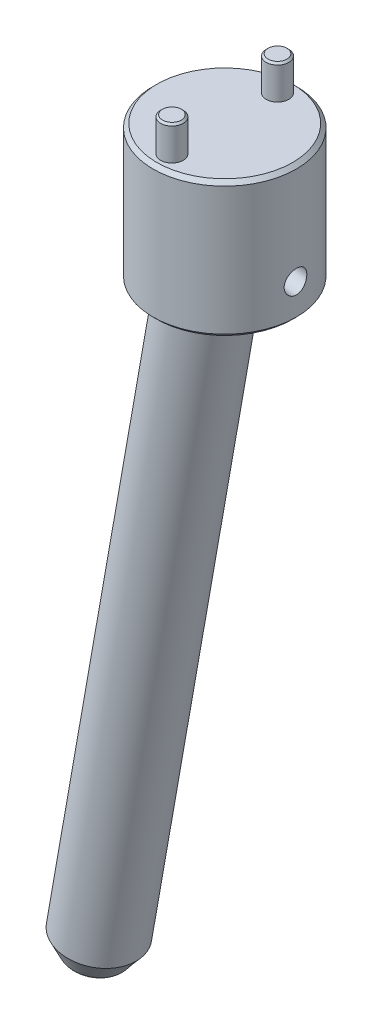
ISO-10303-21;
HEADER;
FILE_DESCRIPTION(('STEP AP214'),'2;1');
FILE_NAME('part.step','',(''),(''),'','','');
FILE_SCHEMA(('AUTOMOTIVE_DESIGN { 1 0 10303 214 1 1 1 1 }'));
ENDSEC;
DATA;
#1=APPLICATION_CONTEXT('core data for automotive mechanical design processes');
#2=APPLICATION_PROTOCOL_DEFINITION('international standard','automotive_design',2000,#1);
#3=PRODUCT_CONTEXT('',#1,'mechanical');
#4=PRODUCT('Part','Part','',(#3));
#5=PRODUCT_RELATED_PRODUCT_CATEGORY('part','',(#4));
#6=PRODUCT_DEFINITION_FORMATION('','',#4);
#7=PRODUCT_DEFINITION_CONTEXT('part definition',#1,'design');
#8=PRODUCT_DEFINITION('design','',#6,#7);
#9=PRODUCT_DEFINITION_SHAPE('','',#8);
#10=(LENGTH_UNIT() NAMED_UNIT(*) SI_UNIT(.MILLI.,.METRE.));
#11=(NAMED_UNIT(*) PLANE_ANGLE_UNIT() SI_UNIT($,.RADIAN.));
#12=(NAMED_UNIT(*) SI_UNIT($,.STERADIAN.) SOLID_ANGLE_UNIT());
#13=UNCERTAINTY_MEASURE_WITH_UNIT(LENGTH_MEASURE(1.E-05),#10,'distance_accuracy_value','');
#14=(GEOMETRIC_REPRESENTATION_CONTEXT(3) GLOBAL_UNCERTAINTY_ASSIGNED_CONTEXT((#13)) GLOBAL_UNIT_ASSIGNED_CONTEXT((#10,
#11,#12)) REPRESENTATION_CONTEXT('',''));
#15=CARTESIAN_POINT('',(0.,0.,0.));
#16=DIRECTION('',(0.,0.,1.));
#17=DIRECTION('',(1.,0.,0.));
#18=AXIS2_PLACEMENT_3D('',#15,#16,#17);
#19=CARTESIAN_POINT('',(-34.388431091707,-208.341356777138,0.));
#20=DIRECTION('',(-0.173648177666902,-0.984807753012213,0.));
#21=DIRECTION('',(0.,0.,-1.));
#22=AXIS2_PLACEMENT_3D('',#19,#20,#21);
#23=PLANE('',#22);
#24=CARTESIAN_POINT('',(-34.388431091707,-208.341356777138,0.));
#25=DIRECTION('',(0.173648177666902,0.984807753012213,0.));
#26=DIRECTION('',(-0.984807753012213,0.173648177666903,0.));
#27=AXIS2_PLACEMENT_3D('',#24,#25,#26);
#28=CIRCLE('',#27,5.38119780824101);
#29=CARTESIAN_POINT('',(-39.6878764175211,-207.406921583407,0.));
#30=VERTEX_POINT('',#29);
#31=CARTESIAN_POINT('',(-29.0889857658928,-209.275791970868,0.));
#32=VERTEX_POINT('',#31);
#33=EDGE_CURVE('P0_E37',#30,#32,#28,.T.);
#34=ORIENTED_EDGE('',*,*,#33,.F.);
#35=CARTESIAN_POINT('',(-34.388431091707,-208.341356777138,0.));
#36=DIRECTION('',(0.173648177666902,0.984807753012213,0.));
#37=DIRECTION('',(0.984807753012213,-0.173648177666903,0.));
#38=AXIS2_PLACEMENT_3D('',#35,#36,#37);
#39=CIRCLE('',#38,5.38119780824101);
#40=EDGE_CURVE('P0_E41',#32,#30,#39,.T.);
#41=ORIENTED_EDGE('',*,*,#40,.F.);
#42=EDGE_LOOP('',(#34,#41));
#43=FACE_BOUND('',#42,.T.);
#44=ADVANCED_FACE('P0_F16',(#43),#23,.T.);
#45=CARTESIAN_POINT('',(-34.0411347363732,-206.371741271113,0.));
#46=DIRECTION('',(-0.173648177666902,-0.984807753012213,0.));
#47=DIRECTION('',(0.984768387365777,-0.173641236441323,0.00894115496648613));
#48=AXIS2_PLACEMENT_3D('',#45,#46,#47);
#49=TOROIDAL_SURFACE('',#48,5.381197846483,2.);
#50=ORIENTED_EDGE('',*,*,#33,.T.);
#51=ORIENTED_EDGE('',*,*,#40,.T.);
#52=EDGE_LOOP('',(#50,#51));
#53=FACE_BOUND('',#52,.T.);
#54=CARTESIAN_POINT('',(-34.2147829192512,-207.356549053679,0.));
#55=DIRECTION('',(0.173648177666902,0.984807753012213,0.));
#56=DIRECTION('',(0.984807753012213,-0.173648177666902,0.));
#57=AXIS2_PLACEMENT_3D('',#54,#55,#56);
#58=CIRCLE('',#57,7.11324863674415);
#59=CARTESIAN_POINT('',(-27.209600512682,-208.591751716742,0.));
#60=VERTEX_POINT('',#59);
#61=EDGE_CURVE('P0_E47',#60,#60,#58,.T.);
#62=ORIENTED_EDGE('',*,*,#61,.F.);
#63=EDGE_LOOP('',(#62));
#64=FACE_BOUND('',#63,.T.);
#65=ADVANCED_FACE('P0_F39',(#53,#64),#49,.T.);
#66=CARTESIAN_POINT('',(1.209445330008,-6.455767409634,0.));
#67=DIRECTION('',(-0.173648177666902,-0.984807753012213,0.));
#68=DIRECTION('',(0.,0.,-1.));
#69=AXIS2_PLACEMENT_3D('',#66,#67,#68);
#70=PLANE('',#69);
#71=CARTESIAN_POINT('',(1.20944536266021,-6.45576722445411,0.));
#72=DIRECTION('',(-0.173648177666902,-0.984807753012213,0.));
#73=DIRECTION('',(0.,0.,-1.));
#74=AXIS2_PLACEMENT_3D('',#71,#72,#73);
#75=CIRCLE('',#74,8.99999984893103);
#76=CARTESIAN_POINT('',(1.20944536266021,-6.45576722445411,-8.99999984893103));
#77=VERTEX_POINT('',#76);
#78=EDGE_CURVE('P0_E84',#77,#77,#75,.T.);
#79=ORIENTED_EDGE('',*,*,#78,.F.);
#80=EDGE_LOOP('',(#79));
#81=FACE_BOUND('',#80,.T.);
#82=ADVANCED_FACE('P0_F75',(#81),#70,.F.);
#83=CARTESIAN_POINT('',(1.93277887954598,-23.8455630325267,0.));
#84=DIRECTION('',(0.984807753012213,-0.173648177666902,0.));
#85=DIRECTION('',(0.,0.,-1.));
#86=AXIS2_PLACEMENT_3D('',#83,#84,#85);
#87=CONICAL_SURFACE('',#86,2.99999999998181,1.04719755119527);
#88=CARTESIAN_POINT('',(0.227041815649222,-23.5447955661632,0.));
#89=VERTEX_POINT('',#88);
#90=VERTEX_LOOP('',#89);
#91=FACE_BOUND('',#90,.T.);
#92=CARTESIAN_POINT('',(1.9327788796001,-23.8455630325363,0.));
#93=DIRECTION('',(0.984807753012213,-0.173648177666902,0.));
#94=DIRECTION('',(0.173648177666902,0.984807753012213,0.));
#95=AXIS2_PLACEMENT_3D('',#92,#93,#94);
#96=CIRCLE('',#95,3.);
#97=CARTESIAN_POINT('',(2.45372341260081,-20.8911397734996,0.));
#98=VERTEX_POINT('',#97);
#99=EDGE_CURVE('P0_E81',#98,#98,#96,.T.);
#100=ORIENTED_EDGE('',*,*,#99,.T.);
#101=EDGE_LOOP('',(#100));
#102=FACE_BOUND('',#101,.T.);
#103=ADVANCED_FACE('P0_F115',(#91,#102),#87,.F.);
#104=CARTESIAN_POINT('',(-33.3465420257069,-202.432510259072,0.));
#105=DIRECTION('',(0.173648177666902,0.984807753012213,0.));
#106=DIRECTION('',(0.,0.,1.));
#107=AXIS2_PLACEMENT_3D('',#104,#105,#106);
#108=CONICAL_SURFACE('',#107,10.0000000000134,0.5235987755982);
#109=CARTESIAN_POINT('',(-33.3465420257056,-202.432510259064,0.));
#110=DIRECTION('',(-0.173648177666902,-0.984807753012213,0.));
#111=DIRECTION('',(0.,0.,-1.));
#112=AXIS2_PLACEMENT_3D('',#109,#110,#111);
#113=CIRCLE('',#112,10.);
#114=CARTESIAN_POINT('',(-33.3465420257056,-202.432510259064,-10.));
#115=VERTEX_POINT('',#114);
#116=EDGE_CURVE('P0_E91',#115,#115,#113,.F.);
#117=ORIENTED_EDGE('',*,*,#116,.F.);
#118=EDGE_LOOP('',(#117));
#119=FACE_BOUND('',#118,.T.);
#120=ORIENTED_EDGE('',*,*,#61,.T.);
#121=EDGE_LOOP('',(#120));
#122=FACE_BOUND('',#121,.T.);
#123=ADVANCED_FACE('P0_F107',(#119,#122),#108,.T.);
#124=CARTESIAN_POINT('',(1.03579712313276,-7.44057532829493,0.));
#125=DIRECTION('',(-0.173648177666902,-0.984807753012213,0.));
#126=DIRECTION('',(0.,0.,-1.));
#127=AXIS2_PLACEMENT_3D('',#124,#125,#126);
#128=CONICAL_SURFACE('',#127,10.0000002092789,0.785398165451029);
#129=CARTESIAN_POINT('',(1.03579708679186,-7.4405755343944,0.));
#130=DIRECTION('',(-0.173648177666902,-0.984807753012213,0.));
#131=DIRECTION('',(0.,0.,-1.));
#132=AXIS2_PLACEMENT_3D('',#129,#130,#131);
#133=CIRCLE('',#132,10.);
#134=CARTESIAN_POINT('',(1.03579708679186,-7.4405755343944,-10.));
#135=VERTEX_POINT('',#134);
#136=EDGE_CURVE('P0_E27',#135,#135,#133,.T.);
#137=ORIENTED_EDGE('',*,*,#136,.F.);
#138=EDGE_LOOP('',(#137));
#139=FACE_BOUND('',#138,.T.);
#140=ORIENTED_EDGE('',*,*,#78,.T.);
#141=EDGE_LOOP('',(#140));
#142=FACE_BOUND('',#141,.T.);
#143=ADVANCED_FACE('P0_F104',(#139,#142),#128,.T.);
#144=CARTESIAN_POINT('',(-0.26536206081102,-23.457971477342,0.));
#145=DIRECTION('',(0.984807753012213,-0.173648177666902,0.));
#146=DIRECTION('',(0.173648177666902,0.984807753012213,0.));
#147=AXIS2_PLACEMENT_3D('',#144,#145,#146);
#148=CYLINDRICAL_SURFACE('',#147,3.);
#149=ORIENTED_EDGE('',*,*,#99,.F.);
#150=EDGE_LOOP('',(#149));
#151=FACE_BOUND('',#150,.T.);
#152=CARTESIAN_POINT('',(8.6264483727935,-21.979557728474,0.));
#153=CARTESIAN_POINT('',(8.62644098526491,-21.9795654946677,-0.164364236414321));
#154=CARTESIAN_POINT('',(8.62005751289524,-21.9922096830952,-0.328908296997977));
#155=CARTESIAN_POINT('',(8.59501270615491,-22.0424361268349,-0.653366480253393));
#156=CARTESIAN_POINT('',(8.57632975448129,-22.0800622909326,-0.813271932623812));
#157=CARTESIAN_POINT('',(8.52822604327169,-22.1790328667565,-1.12348315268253));
#158=CARTESIAN_POINT('',(8.49882733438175,-22.2403285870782,-1.27380789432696));
#159=CARTESIAN_POINT('',(8.43152339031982,-22.3849681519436,-1.56129290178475));
#160=CARTESIAN_POINT('',(8.39361966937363,-22.4683080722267,-1.69845550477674));
#161=CARTESIAN_POINT('',(8.31094433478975,-22.657515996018,-1.95973946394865));
#162=CARTESIAN_POINT('',(8.26601983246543,-22.7639131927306,-2.08342924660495));
#163=CARTESIAN_POINT('',(8.17326349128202,-22.9955088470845,-2.31049290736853));
#164=CARTESIAN_POINT('',(8.12543100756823,-23.1207114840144,-2.41386225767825));
#165=CARTESIAN_POINT('',(8.02909969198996,-23.390202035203,-2.59960101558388));
#166=CARTESIAN_POINT('',(7.98061001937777,-23.5348554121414,-2.68144668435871));
#167=CARTESIAN_POINT('',(7.88747589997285,-23.8374414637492,-2.81842825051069));
#168=CARTESIAN_POINT('',(7.84283050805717,-23.9953708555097,-2.87357072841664));
#169=CARTESIAN_POINT('',(7.76147074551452,-24.3156265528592,-2.95403265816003));
#170=CARTESIAN_POINT('',(7.72456931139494,-24.4777059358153,-2.98014390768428));
#171=CARTESIAN_POINT('',(7.65907486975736,-24.8055748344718,-3.00427461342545));
#172=CARTESIAN_POINT('',(7.63047985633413,-24.9713634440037,-3.00230085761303));
#173=CARTESIAN_POINT('',(7.58327774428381,-25.2955579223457,-2.9709395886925));
#174=CARTESIAN_POINT('',(7.56434735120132,-25.4540142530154,-2.94254427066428));
#175=CARTESIAN_POINT('',(7.53467240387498,-25.7651227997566,-2.86074869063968));
#176=CARTESIAN_POINT('',(7.52392870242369,-25.9177744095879,-2.80734582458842));
#177=CARTESIAN_POINT('',(7.50943193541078,-26.2151430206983,-2.67631861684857));
#178=CARTESIAN_POINT('',(7.50577685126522,-26.3597223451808,-2.59837186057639));
#179=CARTESIAN_POINT('',(7.50403479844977,-26.6348486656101,-2.42069837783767));
#180=CARTESIAN_POINT('',(7.50594885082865,-26.765393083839,-2.32096766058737));
#181=CARTESIAN_POINT('',(7.51351080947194,-27.0141342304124,-2.09764727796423));
#182=CARTESIAN_POINT('',(7.51931073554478,-27.131591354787,-1.97323765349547));
#183=CARTESIAN_POINT('',(7.53250961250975,-27.3441719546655,-1.7065766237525));
#184=CARTESIAN_POINT('',(7.53990924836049,-27.4392858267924,-1.56431758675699));
#185=CARTESIAN_POINT('',(7.55425964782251,-27.6046230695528,-1.26458300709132));
#186=CARTESIAN_POINT('',(7.56120667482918,-27.6746565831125,-1.10700242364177));
#187=CARTESIAN_POINT('',(7.57283983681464,-27.7860885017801,-0.782158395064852));
#188=CARTESIAN_POINT('',(7.57753062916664,-27.8275459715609,-0.61491570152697));
#189=CARTESIAN_POINT('',(7.58187414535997,-27.8653934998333,-0.371824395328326));
#190=CARTESIAN_POINT('',(7.58287592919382,-27.8740121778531,-0.297737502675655));
#191=CARTESIAN_POINT('',(7.58421948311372,-27.8855197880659,-0.14911274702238));
#192=CARTESIAN_POINT('',(7.58456125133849,-27.8884087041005,-0.0745748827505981));
#193=CARTESIAN_POINT('',(7.5845550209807,-27.8883944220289,0.164364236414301));
#194=CARTESIAN_POINT('',(7.5828810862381,-27.8743294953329,0.328908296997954));
#195=CARTESIAN_POINT('',(7.57652512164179,-27.8185662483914,0.653366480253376));
#196=CARTESIAN_POINT('',(7.57183779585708,-27.7768192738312,0.813271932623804));
#197=CARTESIAN_POINT('',(7.5604850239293,-27.6673649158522,1.12348315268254));
#198=CARTESIAN_POINT('',(7.55382364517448,-27.599710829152,1.27380789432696));
#199=CARTESIAN_POINT('',(7.54004827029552,-27.4407747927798,1.56129290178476));
#200=CARTESIAN_POINT('',(7.53293435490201,-27.3494970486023,1.69845550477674));
#201=CARTESIAN_POINT('',(7.51995787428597,-27.1434231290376,1.95973946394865));
#202=CARTESIAN_POINT('',(7.51413263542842,-27.0280773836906,2.08342924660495));
#203=CARTESIAN_POINT('',(7.50618056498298,-26.7787241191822,2.31049290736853));
#204=CARTESIAN_POINT('',(7.50405455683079,-26.6447124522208,2.41386225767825));
#205=CARTESIAN_POINT('',(7.50570392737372,-26.3585269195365,2.59960101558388));
#206=CARTESIAN_POINT('',(7.50961290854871,-26.2060127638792,2.68144668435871));
#207=CARTESIAN_POINT('',(7.52558598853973,-25.8898211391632,2.81842825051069));
#208=CARTESIAN_POINT('',(7.53764807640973,-25.7261464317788,2.87357072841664));
#209=CARTESIAN_POINT('',(7.57072880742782,-25.3973778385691,2.95403265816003));
#210=CARTESIAN_POINT('',(7.59148721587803,-25.2324520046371,2.98014390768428));
#211=CARTESIAN_POINT('',(7.6420803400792,-24.9019556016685,3.00427461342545));
#212=CARTESIAN_POINT('',(7.67191286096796,-24.7363851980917,3.00230085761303));
#213=CARTESIAN_POINT('',(7.73843842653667,-24.4155979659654,2.9709395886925));
#214=CARTESIAN_POINT('',(7.77484493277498,-24.260223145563,2.94254427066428));
#215=CARTESIAN_POINT('',(7.85336499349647,-23.9577273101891,2.86074869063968));
#216=CARTESIAN_POINT('',(7.89547914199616,-23.8106071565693,2.80734582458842));
#217=CARTESIAN_POINT('',(7.98356269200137,-23.526213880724,2.67631861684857));
#218=CARTESIAN_POINT('',(8.02957707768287,-23.3891036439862,2.59837186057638));
#219=CARTESIAN_POINT('',(8.12203882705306,-23.1299736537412,2.42069837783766));
#220=CARTESIAN_POINT('',(8.16848626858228,-23.0079566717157,2.32096766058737));
#221=CARTESIAN_POINT('',(8.26066666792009,-22.7768027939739,2.09764727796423));
#222=CARTESIAN_POINT('',(8.30628951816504,-22.668412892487,1.97323765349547));
#223=CARTESIAN_POINT('',(8.39139925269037,-22.4731667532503,1.7065766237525));
#224=CARTESIAN_POINT('',(8.43088349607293,-22.3863197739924,1.56431758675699));
#225=CARTESIAN_POINT('',(8.5009171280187,-22.2358617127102,1.26458300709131));
#226=CARTESIAN_POINT('',(8.53139807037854,-22.1724277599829,1.10700242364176));
#227=CARTESIAN_POINT('',(8.58044162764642,-22.0716947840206,0.782158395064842));
#228=CARTESIAN_POINT('',(8.59902882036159,-22.0343418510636,0.614915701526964));
#229=CARTESIAN_POINT('',(8.61605500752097,-22.0002623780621,0.371824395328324));
#230=CARTESIAN_POINT('',(8.6199441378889,-21.9925061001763,0.297737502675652));
#231=CARTESIAN_POINT('',(8.62514250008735,-21.9821520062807,0.149112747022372));
#232=CARTESIAN_POINT('',(8.62645172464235,-21.9795542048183,0.0745748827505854));
#233=CARTESIAN_POINT('',(8.6264483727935,-21.979557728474,0.));
#234=B_SPLINE_CURVE_WITH_KNOTS('',3,(#152,#153,#154,#155,#156,#157,#158,#159,#160,#161,#162,
#163,#164,#165,#166,#167,#168,#169,#170,#171,#172,#173,#174,#175,#176,#177,#178,#179,#180,#181,
#182,#183,#184,#185,#186,#187,#188,#189,#190,#191,#192,#193,#194,#195,#196,#197,#198,#199,#200,
#201,#202,#203,#204,#205,#206,#207,#208,#209,#210,#211,#212,#213,#214,#215,#216,#217,#218,#219,
#220,#221,#222,#223,#224,#225,#226,#227,#228,#229,#230,#231,#232,#233),.UNSPECIFIED.,.T.,.F.,(4,
2,2,2,2,2,2,2,2,2,2,2,2,2,2,2,2,2,2,2,2,2,2,2,2,2,2,2,2,2,2,2,2,2,2,2,2,2,2,2,4),(0.,
0.49280574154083,0.986479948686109,1.47914396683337,1.97172034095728,2.47709830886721,
2.98258875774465,3.49943124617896,4.01614630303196,4.51839363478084,5.02051957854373,
5.50451902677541,5.98856888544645,6.47926306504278,6.97004721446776,7.48124851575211,
7.99266913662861,8.507883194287,9.02202912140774,9.24562293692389,9.4692173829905,
9.96202312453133,10.4556973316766,10.9483613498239,11.4409377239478,11.9463156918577,
12.4518061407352,12.9686486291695,13.4853636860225,13.9876110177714,14.4897369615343,
14.9737364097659,15.457786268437,15.9484804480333,16.4392645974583,16.9504658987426,
17.4618865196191,17.9771005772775,18.4912465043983,18.7148403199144,18.938434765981),.UNSPECIFIED.);
#235=CARTESIAN_POINT('',(8.6264483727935,-21.979557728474,0.));
#236=VERTEX_POINT('',#235);
#237=EDGE_CURVE('P0_E10',#236,#236,#234,.T.);
#238=ORIENTED_EDGE('',*,*,#237,.F.);
#239=EDGE_LOOP('',(#238));
#240=FACE_BOUND('',#239,.T.);
#241=ADVANCED_FACE('P0_F106',(#151,#240),#148,.F.);
#242=CARTESIAN_POINT('',(2.98933915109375,3.63851205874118,0.));
#243=DIRECTION('',(-0.173648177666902,-0.984807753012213,0.));
#244=DIRECTION('',(0.,0.,-1.));
#245=AXIS2_PLACEMENT_3D('',#242,#243,#244);
#246=CYLINDRICAL_SURFACE('',#245,10.);
#247=ORIENTED_EDGE('',*,*,#116,.T.);
#248=EDGE_LOOP('',(#247));
#249=FACE_BOUND('',#248,.T.);
#250=ORIENTED_EDGE('',*,*,#136,.T.);
#251=EDGE_LOOP('',(#250));
#252=FACE_BOUND('',#251,.T.);
#253=ORIENTED_EDGE('',*,*,#237,.T.);
#254=EDGE_LOOP('',(#253));
#255=FACE_BOUND('',#254,.T.);
#256=ADVANCED_FACE('P0_F101',(#249,#252,#255),#246,.T.);
#257=CLOSED_SHELL('',(#44,#65,#82,#103,#123,#143,#241,#256));
#258=MANIFOLD_SOLID_BREP('P0_B1',#257);
#259=CARTESIAN_POINT('',(0.,9.,0.));
#260=DIRECTION('',(0.,1.,0.));
#261=DIRECTION('',(-1.,0.,0.));
#262=AXIS2_PLACEMENT_3D('',#259,#260,#261);
#263=PLANE('',#262);
#264=CARTESIAN_POINT('',(0.,9.,-14.));
#265=DIRECTION('',(0.,1.,0.));
#266=DIRECTION('',(-1.,0.,0.));
#267=AXIS2_PLACEMENT_3D('',#264,#265,#266);
#268=CIRCLE('',#267,2.49998893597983);
#269=CARTESIAN_POINT('',(-2.49998893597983,9.,-14.));
#270=VERTEX_POINT('',#269);
#271=EDGE_CURVE('P1_E18',#270,#270,#268,.F.);
#272=ORIENTED_EDGE('',*,*,#271,.F.);
#273=EDGE_LOOP('',(#272));
#274=FACE_BOUND('',#273,.T.);
#275=ADVANCED_FACE('P1_F15',(#274),#263,.T.);
#276=CARTESIAN_POINT('',(0.,9.,0.));
#277=DIRECTION('',(0.,1.,0.));
#278=DIRECTION('',(-1.,0.,0.));
#279=AXIS2_PLACEMENT_3D('',#276,#277,#278);
#280=PLANE('',#279);
#281=CARTESIAN_POINT('',(0.,9.,14.));
#282=DIRECTION('',(0.,1.,0.));
#283=DIRECTION('',(-1.,0.,0.));
#284=AXIS2_PLACEMENT_3D('',#281,#282,#283);
#285=CIRCLE('',#284,2.49998893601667);
#286=CARTESIAN_POINT('',(-2.49998893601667,9.,14.));
#287=VERTEX_POINT('',#286);
#288=EDGE_CURVE('P1_E115',#287,#287,#285,.F.);
#289=ORIENTED_EDGE('',*,*,#288,.F.);
#290=EDGE_LOOP('',(#289));
#291=FACE_BOUND('',#290,.T.);
#292=ADVANCED_FACE('P1_F105',(#291),#280,.T.);
#293=CARTESIAN_POINT('',(1.209445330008,-6.455767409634,0.));
#294=DIRECTION('',(0.173648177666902,0.984807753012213,0.));
#295=DIRECTION('',(-0.984807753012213,0.173648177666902,0.));
#296=AXIS2_PLACEMENT_3D('',#293,#294,#295);
#297=PLANE('',#296);
#298=CARTESIAN_POINT('',(1.20944533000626,-6.4557674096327,0.));
#299=DIRECTION('',(0.173648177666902,0.984807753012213,0.));
#300=DIRECTION('',(-0.984807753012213,0.173648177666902,0.));
#301=AXIS2_PLACEMENT_3D('',#298,#299,#300);
#302=CIRCLE('',#301,10.);
#303=CARTESIAN_POINT('',(-8.63863220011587,-4.71928563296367,0.));
#304=VERTEX_POINT('',#303);
#305=EDGE_CURVE('P1_E117',#304,#304,#302,.F.);
#306=ORIENTED_EDGE('',*,*,#305,.T.);
#307=EDGE_LOOP('',(#306));
#308=FACE_BOUND('',#307,.T.);
#309=ADVANCED_FACE('P1_F102',(#308),#297,.F.);
#310=CARTESIAN_POINT('',(0.,8.49999144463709,-14.));
#311=DIRECTION('',(0.,-1.,0.));
#312=DIRECTION('',(1.,0.,0.));
#313=AXIS2_PLACEMENT_3D('',#310,#311,#312);
#314=CONICAL_SURFACE('',#313,2.99999527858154,0.785395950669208);
#315=CARTESIAN_POINT('',(0.,8.49998672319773,-14.));
#316=DIRECTION('',(0.,-1.,0.));
#317=DIRECTION('',(1.,0.,0.));
#318=AXIS2_PLACEMENT_3D('',#315,#316,#317);
#319=CIRCLE('',#318,3.);
#320=CARTESIAN_POINT('',(3.,8.49998672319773,-14.));
#321=VERTEX_POINT('',#320);
#322=EDGE_CURVE('P1_E119',#321,#321,#319,.T.);
#323=ORIENTED_EDGE('',*,*,#322,.F.);
#324=EDGE_LOOP('',(#323));
#325=FACE_BOUND('',#324,.T.);
#326=ORIENTED_EDGE('',*,*,#271,.T.);
#327=EDGE_LOOP('',(#326));
#328=FACE_BOUND('',#327,.T.);
#329=ADVANCED_FACE('P1_F98',(#325,#328),#314,.T.);
#330=CARTESIAN_POINT('',(0.,8.49999144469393,14.));
#331=DIRECTION('',(0.,-1.,0.));
#332=DIRECTION('',(1.,0.,0.));
#333=AXIS2_PLACEMENT_3D('',#330,#331,#332);
#334=CONICAL_SURFACE('',#333,2.99999527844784,0.785395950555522);
#335=CARTESIAN_POINT('',(0.,8.49998672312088,14.));
#336=DIRECTION('',(0.,-1.,0.));
#337=DIRECTION('',(1.,0.,0.));
#338=AXIS2_PLACEMENT_3D('',#335,#336,#337);
#339=CIRCLE('',#338,3.);
#340=CARTESIAN_POINT('',(3.,8.49998672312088,14.));
#341=VERTEX_POINT('',#340);
#342=EDGE_CURVE('P1_E124',#341,#341,#339,.T.);
#343=ORIENTED_EDGE('',*,*,#342,.F.);
#344=EDGE_LOOP('',(#343));
#345=FACE_BOUND('',#344,.T.);
#346=ORIENTED_EDGE('',*,*,#288,.T.);
#347=EDGE_LOOP('',(#346));
#348=FACE_BOUND('',#347,.T.);
#349=ADVANCED_FACE('P1_F93',(#345,#348),#334,.T.);
#350=CARTESIAN_POINT('',(-6.41042959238,-49.67022552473,0.));
#351=DIRECTION('',(0.173648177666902,0.984807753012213,0.));
#352=DIRECTION('',(-0.984807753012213,0.173648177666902,0.));
#353=AXIS2_PLACEMENT_3D('',#350,#351,#352);
#354=CYLINDRICAL_SURFACE('',#353,10.);
#355=CARTESIAN_POINT('',(-4.00000000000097,-36.,0.));
#356=DIRECTION('',(0.,-1.,0.));
#357=DIRECTION('',(1.,0.,0.));
#358=AXIS2_PLACEMENT_3D('',#355,#356,#357);
#359=ELLIPSE('',#358,10.1542661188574,10.);
#360=CARTESIAN_POINT('',(6.15426611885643,-36.,0.));
#361=VERTEX_POINT('',#360);
#362=EDGE_CURVE('P1_E80',#361,#361,#359,.F.);
#363=ORIENTED_EDGE('',*,*,#362,.F.);
#364=EDGE_LOOP('',(#363));
#365=FACE_BOUND('',#364,.T.);
#366=ORIENTED_EDGE('',*,*,#305,.F.);
#367=EDGE_LOOP('',(#366));
#368=FACE_BOUND('',#367,.T.);
#369=CARTESIAN_POINT('',(7.58455930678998,-27.8884042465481,0.));
#370=CARTESIAN_POINT('',(7.58455502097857,-27.8883944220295,-0.16436423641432));
#371=CARTESIAN_POINT('',(7.58288108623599,-27.8743294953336,-0.328908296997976));
#372=CARTESIAN_POINT('',(7.57652512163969,-27.8185662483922,-0.653366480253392));
#373=CARTESIAN_POINT('',(7.57183779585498,-27.776819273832,-0.813271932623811));
#374=CARTESIAN_POINT('',(7.5604850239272,-27.667364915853,-1.12348315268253));
#375=CARTESIAN_POINT('',(7.55382364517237,-27.5997108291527,-1.27380789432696));
#376=CARTESIAN_POINT('',(7.54004827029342,-27.4407747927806,-1.56129290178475));
#377=CARTESIAN_POINT('',(7.53293435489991,-27.3494970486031,-1.69845550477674));
#378=CARTESIAN_POINT('',(7.51995787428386,-27.1434231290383,-1.95973946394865));
#379=CARTESIAN_POINT('',(7.51413263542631,-27.0280773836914,-2.08342924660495));
#380=CARTESIAN_POINT('',(7.50618056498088,-26.778724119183,-2.31049290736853));
#381=CARTESIAN_POINT('',(7.50405455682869,-26.6447124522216,-2.41386225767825));
#382=CARTESIAN_POINT('',(7.50570392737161,-26.3585269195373,-2.59960101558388));
#383=CARTESIAN_POINT('',(7.5096129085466,-26.2060127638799,-2.68144668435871));
#384=CARTESIAN_POINT('',(7.52558598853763,-25.889821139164,-2.81842825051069));
#385=CARTESIAN_POINT('',(7.53764807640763,-25.7261464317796,-2.87357072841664));
#386=CARTESIAN_POINT('',(7.57072880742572,-25.3973778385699,-2.95403265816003));
#387=CARTESIAN_POINT('',(7.59148721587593,-25.2324520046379,-2.98014390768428));
#388=CARTESIAN_POINT('',(7.64208034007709,-24.9019556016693,-3.00427461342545));
#389=CARTESIAN_POINT('',(7.67191286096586,-24.7363851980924,-3.00230085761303));
#390=CARTESIAN_POINT('',(7.73843842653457,-24.4155979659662,-2.9709395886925));
#391=CARTESIAN_POINT('',(7.77484493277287,-24.2602231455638,-2.94254427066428));
#392=CARTESIAN_POINT('',(7.85336499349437,-23.9577273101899,-2.86074869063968));
#393=CARTESIAN_POINT('',(7.89547914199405,-23.8106071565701,-2.80734582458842));
#394=CARTESIAN_POINT('',(7.98356269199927,-23.5262138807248,-2.67631861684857));
#395=CARTESIAN_POINT('',(8.02957707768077,-23.389103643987,-2.59837186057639));
#396=CARTESIAN_POINT('',(8.12203882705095,-23.129973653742,-2.42069837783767));
#397=CARTESIAN_POINT('',(8.16848626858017,-23.0079566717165,-2.32096766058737));
#398=CARTESIAN_POINT('',(8.26066666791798,-22.7768027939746,-2.09764727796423));
#399=CARTESIAN_POINT('',(8.30628951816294,-22.6684128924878,-1.97323765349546));
#400=CARTESIAN_POINT('',(8.39139925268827,-22.473166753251,-1.70657662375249));
#401=CARTESIAN_POINT('',(8.43088349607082,-22.3863197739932,-1.56431758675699));
#402=CARTESIAN_POINT('',(8.50091712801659,-22.235861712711,-1.26458300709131));
#403=CARTESIAN_POINT('',(8.53139807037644,-22.1724277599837,-1.10700242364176));
#404=CARTESIAN_POINT('',(8.58044162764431,-22.0716947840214,-0.782158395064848));
#405=CARTESIAN_POINT('',(8.59902882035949,-22.0343418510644,-0.614915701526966));
#406=CARTESIAN_POINT('',(8.61605500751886,-22.0002623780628,-0.371824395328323));
#407=CARTESIAN_POINT('',(8.61994413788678,-21.9925061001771,-0.297737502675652));
#408=CARTESIAN_POINT('',(8.62514250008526,-21.9821520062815,-0.149112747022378));
#409=CARTESIAN_POINT('',(8.62645172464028,-21.979554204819,-0.0745748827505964));
#410=CARTESIAN_POINT('',(8.62644098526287,-21.9795654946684,0.164364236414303));
#411=CARTESIAN_POINT('',(8.62005751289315,-21.9922096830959,0.328908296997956));
#412=CARTESIAN_POINT('',(8.5950127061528,-22.0424361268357,0.653366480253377));
#413=CARTESIAN_POINT('',(8.57632975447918,-22.0800622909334,0.813271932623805));
#414=CARTESIAN_POINT('',(8.52822604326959,-22.1790328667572,1.12348315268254));
#415=CARTESIAN_POINT('',(8.49882733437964,-22.240328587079,1.27380789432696));
#416=CARTESIAN_POINT('',(8.43152339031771,-22.3849681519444,1.56129290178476));
#417=CARTESIAN_POINT('',(8.39361966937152,-22.4683080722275,1.69845550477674));
#418=CARTESIAN_POINT('',(8.31094433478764,-22.6575159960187,1.95973946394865));
#419=CARTESIAN_POINT('',(8.26601983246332,-22.7639131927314,2.08342924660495));
#420=CARTESIAN_POINT('',(8.17326349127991,-22.9955088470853,2.31049290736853));
#421=CARTESIAN_POINT('',(8.12543100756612,-23.1207114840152,2.41386225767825));
#422=CARTESIAN_POINT('',(8.02909969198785,-23.3902020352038,2.59960101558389));
#423=CARTESIAN_POINT('',(7.98061001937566,-23.5348554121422,2.68144668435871));
#424=CARTESIAN_POINT('',(7.88747589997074,-23.83744146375,2.81842825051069));
#425=CARTESIAN_POINT('',(7.84283050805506,-23.9953708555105,2.87357072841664));
#426=CARTESIAN_POINT('',(7.76147074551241,-24.3156265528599,2.95403265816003));
#427=CARTESIAN_POINT('',(7.72456931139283,-24.4777059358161,2.98014390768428));
#428=CARTESIAN_POINT('',(7.65907486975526,-24.8055748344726,3.00427461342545));
#429=CARTESIAN_POINT('',(7.63047985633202,-24.9713634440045,3.00230085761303));
#430=CARTESIAN_POINT('',(7.5832777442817,-25.2955579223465,2.9709395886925));
#431=CARTESIAN_POINT('',(7.56434735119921,-25.4540142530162,2.94254427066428));
#432=CARTESIAN_POINT('',(7.53467240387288,-25.7651227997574,2.86074869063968));
#433=CARTESIAN_POINT('',(7.52392870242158,-25.9177744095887,2.80734582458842));
#434=CARTESIAN_POINT('',(7.50943193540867,-26.2151430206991,2.67631861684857));
#435=CARTESIAN_POINT('',(7.50577685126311,-26.3597223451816,2.59837186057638));
#436=CARTESIAN_POINT('',(7.50403479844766,-26.6348486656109,2.42069837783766));
#437=CARTESIAN_POINT('',(7.50594885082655,-26.7653930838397,2.32096766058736));
#438=CARTESIAN_POINT('',(7.51351080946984,-27.0141342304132,2.09764727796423));
#439=CARTESIAN_POINT('',(7.51931073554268,-27.1315913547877,1.97323765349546));
#440=CARTESIAN_POINT('',(7.53250961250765,-27.3441719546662,1.70657662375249));
#441=CARTESIAN_POINT('',(7.53990924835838,-27.4392858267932,1.56431758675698));
#442=CARTESIAN_POINT('',(7.55425964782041,-27.6046230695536,1.26458300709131));
#443=CARTESIAN_POINT('',(7.56120667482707,-27.6746565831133,1.10700242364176));
#444=CARTESIAN_POINT('',(7.57283983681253,-27.7860885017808,0.782158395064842));
#445=CARTESIAN_POINT('',(7.57753062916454,-27.8275459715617,0.614915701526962));
#446=CARTESIAN_POINT('',(7.58187414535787,-27.8653934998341,0.371824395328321));
#447=CARTESIAN_POINT('',(7.58287592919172,-27.8740121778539,0.297737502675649));
#448=CARTESIAN_POINT('',(7.58421948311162,-27.8855197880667,0.149112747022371));
#449=CARTESIAN_POINT('',(7.58456125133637,-27.8884087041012,0.0745748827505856));
#450=CARTESIAN_POINT('',(7.58455930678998,-27.8884042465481,0.));
#451=B_SPLINE_CURVE_WITH_KNOTS('',3,(#369,#370,#371,#372,#373,#374,#375,#376,#377,#378,#379,
#380,#381,#382,#383,#384,#385,#386,#387,#388,#389,#390,#391,#392,#393,#394,#395,#396,#397,#398,
#399,#400,#401,#402,#403,#404,#405,#406,#407,#408,#409,#410,#411,#412,#413,#414,#415,#416,#417,
#418,#419,#420,#421,#422,#423,#424,#425,#426,#427,#428,#429,#430,#431,#432,#433,#434,#435,#436,
#437,#438,#439,#440,#441,#442,#443,#444,#445,#446,#447,#448,#449,#450),.UNSPECIFIED.,.T.,.F.,(4,
2,2,2,2,2,2,2,2,2,2,2,2,2,2,2,2,2,2,2,2,2,2,2,2,2,2,2,2,2,2,2,2,2,2,2,2,2,2,2,4),(0.,
0.49280574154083,0.98647994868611,1.47914396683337,1.97172034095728,2.47709830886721,
2.98258875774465,3.49943124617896,4.01614630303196,4.51839363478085,5.02051957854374,
5.50451902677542,5.98856888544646,6.47926306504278,6.97004721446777,7.48124851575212,
7.99266913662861,8.507883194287,9.02202912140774,9.24562293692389,9.4692173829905,
9.96202312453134,10.4556973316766,10.9483613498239,11.4409377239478,11.9463156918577,
12.4518061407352,12.9686486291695,13.4853636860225,13.9876110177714,14.4897369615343,
14.9737364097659,15.457786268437,15.9484804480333,16.4392645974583,16.9504658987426,
17.4618865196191,17.9771005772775,18.4912465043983,18.7148403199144,18.938434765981),.UNSPECIFIED.);
#452=CARTESIAN_POINT('',(7.58455930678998,-27.8884042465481,0.));
#453=VERTEX_POINT('',#452);
#454=EDGE_CURVE('P1_E77',#453,#453,#451,.T.);
#455=ORIENTED_EDGE('',*,*,#454,.T.);
#456=EDGE_LOOP('',(#455));
#457=FACE_BOUND('',#456,.T.);
#458=ADVANCED_FACE('P1_F87',(#365,#368,#457),#354,.F.);
#459=CARTESIAN_POINT('',(0.,0.,-14.));
#460=DIRECTION('',(0.,1.,0.));
#461=DIRECTION('',(-1.,0.,0.));
#462=AXIS2_PLACEMENT_3D('',#459,#460,#461);
#463=CYLINDRICAL_SURFACE('',#462,3.);
#464=CARTESIAN_POINT('',(0.,0.,-14.));
#465=DIRECTION('',(0.,1.,0.));
#466=DIRECTION('',(-1.,0.,0.));
#467=AXIS2_PLACEMENT_3D('',#464,#465,#466);
#468=CIRCLE('',#467,3.);
#469=CARTESIAN_POINT('',(-3.,0.,-14.));
#470=VERTEX_POINT('',#469);
#471=EDGE_CURVE('P1_E73',#470,#470,#468,.T.);
#472=ORIENTED_EDGE('',*,*,#471,.T.);
#473=EDGE_LOOP('',(#472));
#474=FACE_BOUND('',#473,.T.);
#475=ORIENTED_EDGE('',*,*,#322,.T.);
#476=EDGE_LOOP('',(#475));
#477=FACE_BOUND('',#476,.T.);
#478=ADVANCED_FACE('P1_F92',(#474,#477),#463,.T.);
#479=CARTESIAN_POINT('',(0.,0.,14.));
#480=DIRECTION('',(0.,1.,0.));
#481=DIRECTION('',(-1.,0.,0.));
#482=AXIS2_PLACEMENT_3D('',#479,#480,#481);
#483=CYLINDRICAL_SURFACE('',#482,3.);
#484=CARTESIAN_POINT('',(0.,0.,14.));
#485=DIRECTION('',(0.,1.,0.));
#486=DIRECTION('',(-1.,0.,0.));
#487=AXIS2_PLACEMENT_3D('',#484,#485,#486);
#488=CIRCLE('',#487,3.);
#489=CARTESIAN_POINT('',(-3.,0.,14.));
#490=VERTEX_POINT('',#489);
#491=EDGE_CURVE('P1_E69',#490,#490,#488,.T.);
#492=ORIENTED_EDGE('',*,*,#491,.T.);
#493=EDGE_LOOP('',(#492));
#494=FACE_BOUND('',#493,.T.);
#495=ORIENTED_EDGE('',*,*,#342,.T.);
#496=EDGE_LOOP('',(#495));
#497=FACE_BOUND('',#496,.T.);
#498=ADVANCED_FACE('P1_F140',(#494,#497),#483,.T.);
#499=CARTESIAN_POINT('',(0.,-36.,0.));
#500=DIRECTION('',(0.,-1.,0.));
#501=DIRECTION('',(1.,0.,0.));
#502=AXIS2_PLACEMENT_3D('',#499,#500,#501);
#503=PLANE('',#502);
#504=ORIENTED_EDGE('',*,*,#362,.T.);
#505=EDGE_LOOP('',(#504));
#506=FACE_BOUND('',#505,.T.);
#507=CARTESIAN_POINT('',(0.,-36.,0.));
#508=DIRECTION('',(0.,-1.,0.));
#509=DIRECTION('',(1.,0.,0.));
#510=AXIS2_PLACEMENT_3D('',#507,#508,#509);
#511=CIRCLE('',#510,17.9999935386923);
#512=CARTESIAN_POINT('',(17.9999935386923,-36.,0.));
#513=VERTEX_POINT('',#512);
#514=EDGE_CURVE('P1_E39',#513,#513,#511,.F.);
#515=ORIENTED_EDGE('',*,*,#514,.F.);
#516=EDGE_LOOP('',(#515));
#517=FACE_BOUND('',#516,.T.);
#518=ADVANCED_FACE('P1_F64',(#506,#517),#503,.T.);
#519=CARTESIAN_POINT('',(-6.0610902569,-22.43602822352,0.));
#520=DIRECTION('',(0.984807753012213,-0.173648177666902,0.));
#521=DIRECTION('',(0.173648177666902,0.984807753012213,0.));
#522=AXIS2_PLACEMENT_3D('',#519,#520,#521);
#523=CYLINDRICAL_SURFACE('',#522,3.);
#524=ORIENTED_EDGE('',*,*,#454,.F.);
#525=EDGE_LOOP('',(#524));
#526=FACE_BOUND('',#525,.T.);
#527=CARTESIAN_POINT('',(19.,-23.8086947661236,0.));
#528=CARTESIAN_POINT('',(18.9999968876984,-23.8087019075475,-0.168302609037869));
#529=CARTESIAN_POINT('',(18.9977389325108,-23.822733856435,-0.336810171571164));
#530=CARTESIAN_POINT('',(18.9889402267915,-23.8785693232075,-0.669274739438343));
#531=CARTESIAN_POINT('',(18.9823910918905,-23.9204272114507,-0.833222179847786));
#532=CARTESIAN_POINT('',(18.965738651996,-24.0308235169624,-1.15158233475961));
#533=CARTESIAN_POINT('',(18.9556378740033,-24.0993429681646,-1.30600173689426));
#534=CARTESIAN_POINT('',(18.9330110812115,-24.2612184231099,-1.60093485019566));
#535=CARTESIAN_POINT('',(18.9204861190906,-24.3545636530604,-1.74145455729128));
#536=CARTESIAN_POINT('',(18.8944284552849,-24.5634676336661,-2.00450802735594));
#537=CARTESIAN_POINT('',(18.8808969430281,-24.6790004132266,-2.12706252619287));
#538=CARTESIAN_POINT('',(18.8543376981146,-24.9291711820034,-2.35089087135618));
#539=CARTESIAN_POINT('',(18.8413099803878,-25.0638097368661,-2.45216408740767));
#540=CARTESIAN_POINT('',(18.8172794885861,-25.3478013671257,-2.63022108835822));
#541=CARTESIAN_POINT('',(18.8062687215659,-25.4970925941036,-2.70710246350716));
#542=CARTESIAN_POINT('',(18.7874299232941,-25.8065774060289,-2.83490279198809));
#543=CARTESIAN_POINT('',(18.7796018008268,-25.9667706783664,-2.88582248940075));
#544=CARTESIAN_POINT('',(18.7679618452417,-26.2936911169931,-2.96058361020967));
#545=CARTESIAN_POINT('',(18.7641549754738,-26.4604260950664,-2.98439157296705));
#546=CARTESIAN_POINT('',(18.7609422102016,-26.7955804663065,-3.00452162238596));
#547=CARTESIAN_POINT('',(18.7615367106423,-26.9640000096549,-3.00084123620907));
#548=CARTESIAN_POINT('',(18.7670496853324,-27.3008544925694,-2.96616831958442));
#549=CARTESIAN_POINT('',(18.772042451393,-27.4692397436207,-2.93470650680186));
#550=CARTESIAN_POINT('',(18.7858483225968,-27.7985550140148,-2.8449855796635));
#551=CARTESIAN_POINT('',(18.7946621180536,-27.9594836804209,-2.78672162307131));
#552=CARTESIAN_POINT('',(18.8153925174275,-28.2737770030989,-2.64317643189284));
#553=CARTESIAN_POINT('',(18.8273848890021,-28.4268298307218,-2.55722258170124));
#554=CARTESIAN_POINT('',(18.8529853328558,-28.7163870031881,-2.36107996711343));
#555=CARTESIAN_POINT('',(18.8665934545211,-28.8528908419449,-2.25089046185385));
#556=CARTESIAN_POINT('',(18.8939758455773,-29.1062156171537,-2.00814772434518));
#557=CARTESIAN_POINT('',(18.9077506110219,-29.2228919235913,-1.87544319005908));
#558=CARTESIAN_POINT('',(18.9337530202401,-29.431528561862,-1.59163092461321));
#559=CARTESIAN_POINT('',(18.9459802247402,-29.5234818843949,-1.44051799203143));
#560=CARTESIAN_POINT('',(18.9670541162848,-29.6767845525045,-1.12888993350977));
#561=CARTESIAN_POINT('',(18.9759927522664,-29.7389838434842,-0.968803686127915));
#562=CARTESIAN_POINT('',(18.9864330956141,-29.8104420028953,-0.722605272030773));
#563=CARTESIAN_POINT('',(18.9894176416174,-29.8306152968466,-0.63958291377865));
#564=CARTESIAN_POINT('',(18.9943189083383,-29.863544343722,-0.472063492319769));
#565=CARTESIAN_POINT('',(18.996236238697,-29.876304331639,-0.387567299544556));
#566=CARTESIAN_POINT('',(18.9983898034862,-29.8906020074,-0.252420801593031));
#567=CARTESIAN_POINT('',(18.9989927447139,-29.8945942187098,-0.202022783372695));
#568=CARTESIAN_POINT('',(18.9997983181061,-29.8999219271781,-0.101090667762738));
#569=CARTESIAN_POINT('',(19.0000009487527,-29.9012574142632,-0.0505565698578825));
#570=CARTESIAN_POINT('',(18.9999969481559,-29.901244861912,0.16262485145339));
#571=CARTESIAN_POINT('',(18.9978874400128,-29.8873860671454,0.325482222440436));
#572=CARTESIAN_POINT('',(18.9896757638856,-29.8324296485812,0.646650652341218));
#573=CARTESIAN_POINT('',(18.9835649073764,-29.7912727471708,0.804951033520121));
#574=CARTESIAN_POINT('',(18.9680525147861,-29.6833849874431,1.11200883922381));
#575=CARTESIAN_POINT('',(18.9586583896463,-29.6167116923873,1.26078687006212));
#576=CARTESIAN_POINT('',(18.9375942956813,-29.460149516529,1.54528376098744));
#577=CARTESIAN_POINT('',(18.9259250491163,-29.3702680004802,1.6810067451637));
#578=CARTESIAN_POINT('',(18.9011726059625,-29.1672777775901,1.93986289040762));
#579=CARTESIAN_POINT('',(18.888059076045,-29.053591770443,2.06254000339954));
#580=CARTESIAN_POINT('',(18.862074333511,-28.8079373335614,2.28802634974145));
#581=CARTESIAN_POINT('',(18.8492031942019,-28.6759634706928,2.39082965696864));
#582=CARTESIAN_POINT('',(18.8245085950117,-28.3911542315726,2.57822041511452));
#583=CARTESIAN_POINT('',(18.812755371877,-28.2376597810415,2.66181709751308));
#584=CARTESIAN_POINT('',(18.7922989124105,-27.9187998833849,2.80260348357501));
#585=CARTESIAN_POINT('',(18.7835959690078,-27.7534332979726,2.85979065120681));
#586=CARTESIAN_POINT('',(18.7701836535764,-27.413235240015,2.94655388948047));
#587=CARTESIAN_POINT('',(18.7655251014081,-27.2383118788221,2.9757790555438));
#588=CARTESIAN_POINT('',(18.7610035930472,-26.8859755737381,3.00415775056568));
#589=CARTESIAN_POINT('',(18.7611400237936,-26.70856295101,3.00331512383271));
#590=CARTESIAN_POINT('',(18.7662073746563,-26.3601929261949,2.97148176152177));
#591=CARTESIAN_POINT('',(18.7710399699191,-26.1891777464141,2.94110929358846));
#592=CARTESIAN_POINT('',(18.7848386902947,-25.8550071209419,2.85164291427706));
#593=CARTESIAN_POINT('',(18.7938042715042,-25.6918506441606,2.79255278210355));
#594=CARTESIAN_POINT('',(18.8145742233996,-25.3821749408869,2.64894259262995));
#595=CARTESIAN_POINT('',(18.8263044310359,-25.2353480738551,2.56507439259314));
#596=CARTESIAN_POINT('',(18.8513824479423,-24.9581446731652,2.37374242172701));
#597=CARTESIAN_POINT('',(18.8647300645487,-24.8277661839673,2.26628146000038));
#598=CARTESIAN_POINT('',(18.8914194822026,-24.5880964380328,2.03176144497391));
#599=CARTESIAN_POINT('',(18.9047604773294,-24.4786449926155,1.90486586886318));
#600=CARTESIAN_POINT('',(18.9300620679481,-24.2824609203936,1.63437175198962));
#601=CARTESIAN_POINT('',(18.9420220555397,-24.1957382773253,1.49076591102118));
#602=CARTESIAN_POINT('',(18.9632731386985,-24.0470820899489,1.19038991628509));
#603=CARTESIAN_POINT('',(18.9725535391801,-23.9852475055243,1.03357015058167));
#604=CARTESIAN_POINT('',(18.9873386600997,-23.8885664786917,0.711876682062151));
#605=CARTESIAN_POINT('',(18.9928506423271,-23.8536681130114,0.547019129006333));
#606=CARTESIAN_POINT('',(18.9974535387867,-23.8246587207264,0.317466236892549));
#607=CARTESIAN_POINT('',(18.998406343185,-23.8186766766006,0.254132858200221));
#608=CARTESIAN_POINT('',(18.999680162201,-23.810693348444,0.12720941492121));
#609=CARTESIAN_POINT('',(19.0000011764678,-23.8086920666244,0.0636193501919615));
#610=CARTESIAN_POINT('',(19.,-23.8086947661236,0.));
#611=B_SPLINE_CURVE_WITH_KNOTS('',3,(#527,#528,#529,#530,#531,#532,#533,#534,#535,#536,#537,
#538,#539,#540,#541,#542,#543,#544,#545,#546,#547,#548,#549,#550,#551,#552,#553,#554,#555,#556,
#557,#558,#559,#560,#561,#562,#563,#564,#565,#566,#567,#568,#569,#570,#571,#572,#573,#574,#575,
#576,#577,#578,#579,#580,#581,#582,#583,#584,#585,#586,#587,#588,#589,#590,#591,#592,#593,#594,
#595,#596,#597,#598,#599,#600,#601,#602,#603,#604,#605,#606,#607,#608,#609,#610),.UNSPECIFIED.,
.T.,.F.,(4,2,2,2,2,2,2,2,2,2,2,2,2,2,2,2,2,2,2,2,2,2,2,2,2,2,2,2,2,2,2,2,2,2,2,2,2,2,2,2,2,4),
(0.,0.504668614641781,1.01032623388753,1.5156248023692,2.02070444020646,2.52519643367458,
3.0297033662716,3.53216557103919,4.03461337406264,4.53768061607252,5.04079311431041,
5.55257029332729,6.06443996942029,6.5898223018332,7.11522069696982,7.6443007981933,
8.17353074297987,8.68657546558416,8.94276882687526,9.19881568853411,9.35042582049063,
9.50203652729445,9.9897212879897,10.4784685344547,10.9661196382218,11.4536161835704,
11.9546931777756,12.4559193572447,12.9790198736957,13.5021706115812,14.0318036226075,
14.5613689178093,15.0800802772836,15.5987233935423,16.1047814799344,16.610779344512,
17.1127336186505,17.6149080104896,18.1190598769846,18.6222374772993,18.8130049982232,
19.0037726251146),.UNSPECIFIED.);
#612=CARTESIAN_POINT('',(19.,-23.8086947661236,0.));
#613=VERTEX_POINT('',#612);
#614=EDGE_CURVE('P1_E32',#613,#613,#611,.T.);
#615=ORIENTED_EDGE('',*,*,#614,.F.);
#616=EDGE_LOOP('',(#615));
#617=FACE_BOUND('',#616,.T.);
#618=ADVANCED_FACE('P1_F41',(#526,#617),#523,.F.);
#619=CARTESIAN_POINT('',(0.,0.,0.));
#620=DIRECTION('',(0.,-1.,0.));
#621=DIRECTION('',(1.,0.,0.));
#622=AXIS2_PLACEMENT_3D('',#619,#620,#621);
#623=PLANE('',#622);
#624=ORIENTED_EDGE('',*,*,#491,.F.);
#625=EDGE_LOOP('',(#624));
#626=FACE_BOUND('',#625,.T.);
#627=ORIENTED_EDGE('',*,*,#471,.F.);
#628=EDGE_LOOP('',(#627));
#629=FACE_BOUND('',#628,.T.);
#630=CARTESIAN_POINT('',(0.,0.,0.));
#631=DIRECTION('',(0.,-1.,0.));
#632=DIRECTION('',(1.,0.,0.));
#633=AXIS2_PLACEMENT_3D('',#630,#631,#632);
#634=CIRCLE('',#633,17.9999934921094);
#635=CARTESIAN_POINT('',(17.9999934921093,0.,0.));
#636=VERTEX_POINT('',#635);
#637=EDGE_CURVE('P1_E27',#636,#636,#634,.T.);
#638=ORIENTED_EDGE('',*,*,#637,.F.);
#639=EDGE_LOOP('',(#638));
#640=FACE_BOUND('',#639,.T.);
#641=ADVANCED_FACE('P1_F56',(#626,#629,#640),#623,.F.);
#642=CARTESIAN_POINT('',(0.,-34.99999620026,0.));
#643=DIRECTION('',(0.,1.,0.));
#644=DIRECTION('',(-1.,0.,0.));
#645=AXIS2_PLACEMENT_3D('',#642,#643,#644);
#646=CONICAL_SURFACE('',#645,18.9999969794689,0.785397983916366);
#647=ORIENTED_EDGE('',*,*,#514,.T.);
#648=EDGE_LOOP('',(#647));
#649=FACE_BOUND('',#648,.T.);
#650=CARTESIAN_POINT('',(0.,-34.99999922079,0.));
#651=DIRECTION('',(0.,-1.,0.));
#652=DIRECTION('',(1.,0.,0.));
#653=AXIS2_PLACEMENT_3D('',#650,#651,#652);
#654=CIRCLE('',#653,19.);
#655=CARTESIAN_POINT('',(19.,-34.99999922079,0.));
#656=VERTEX_POINT('',#655);
#657=EDGE_CURVE('P1_E22',#656,#656,#654,.F.);
#658=ORIENTED_EDGE('',*,*,#657,.F.);
#659=EDGE_LOOP('',(#658));
#660=FACE_BOUND('',#659,.T.);
#661=ADVANCED_FACE('P1_F53',(#649,#660),#646,.T.);
#662=CARTESIAN_POINT('',(0.,-1.00000391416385,0.));
#663=DIRECTION('',(0.,-1.,0.));
#664=DIRECTION('',(1.,0.,0.));
#665=AXIS2_PLACEMENT_3D('',#662,#663,#664);
#666=CONICAL_SURFACE('',#665,18.9999970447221,0.785397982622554);
#667=CARTESIAN_POINT('',(0.,-1.000000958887,0.));
#668=DIRECTION('',(0.,-1.,0.));
#669=DIRECTION('',(1.,0.,0.));
#670=AXIS2_PLACEMENT_3D('',#667,#668,#669);
#671=CIRCLE('',#670,19.);
#672=CARTESIAN_POINT('',(19.,-1.000000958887,0.));
#673=VERTEX_POINT('',#672);
#674=EDGE_CURVE('P1_E10',#673,#673,#671,.T.);
#675=ORIENTED_EDGE('',*,*,#674,.F.);
#676=EDGE_LOOP('',(#675));
#677=FACE_BOUND('',#676,.T.);
#678=ORIENTED_EDGE('',*,*,#637,.T.);
#679=EDGE_LOOP('',(#678));
#680=FACE_BOUND('',#679,.T.);
#681=ADVANCED_FACE('P1_F49',(#677,#680),#666,.T.);
#682=CARTESIAN_POINT('',(0.,1.8,0.));
#683=DIRECTION('',(0.,-1.,0.));
#684=DIRECTION('',(1.,0.,0.));
#685=AXIS2_PLACEMENT_3D('',#682,#683,#684);
#686=CYLINDRICAL_SURFACE('',#685,19.);
#687=ORIENTED_EDGE('',*,*,#657,.T.);
#688=EDGE_LOOP('',(#687));
#689=FACE_BOUND('',#688,.T.);
#690=ORIENTED_EDGE('',*,*,#674,.T.);
#691=EDGE_LOOP('',(#690));
#692=FACE_BOUND('',#691,.T.);
#693=ORIENTED_EDGE('',*,*,#614,.T.);
#694=EDGE_LOOP('',(#693));
#695=FACE_BOUND('',#694,.T.);
#696=ADVANCED_FACE('P1_F45',(#689,#692,#695),#686,.T.);
#697=CLOSED_SHELL('',(#275,#292,#309,#329,#349,#458,#478,#498,#518,#618,#641,#661,#681,#696));
#698=MANIFOLD_SOLID_BREP('P1_B1',#697);
#699=ADVANCED_BREP_SHAPE_REPRESENTATION('',(#18,#258,#698),#14);
#700=SHAPE_DEFINITION_REPRESENTATION(#9,#699);
ENDSEC;
END-ISO-10303-21;
